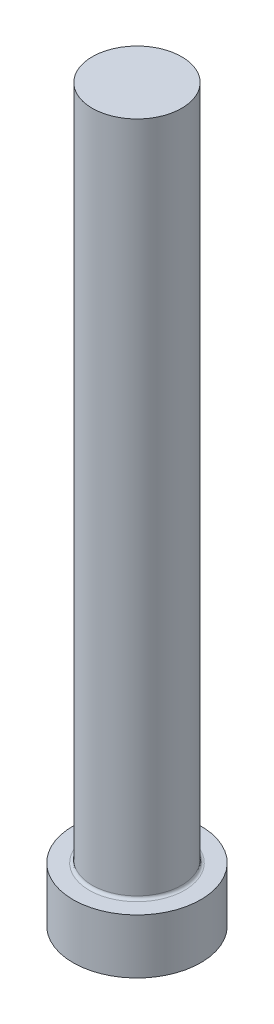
from build123d import *


with BuildPart() as part:
    # Sketch1 → Revolve3 (revolve)
    with BuildSketch(Plane.XY, mode=Mode.PRIVATE) as revolve3_sk:
        with BuildLine():
            Line((0, 0), (5.5499, 0))
            Line((5.5499, 0), (5.5499, 4.7498))
            Line((5.5499, 4.7498), (4.1402, 4.7498))
            ThreePointArc((4.1402, 4.7498), (3.960594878, 4.824194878), (3.8862, 5.0038))
            Line((3.8862, 5.0038), (3.8862, 63.5))
            Line((3.8862, 63.5), (0, 63.5))
            Line((0, 63.5), (0, 0))
        make_face()
    revolve(revolve3_sk.sketch.rotate(Axis((0, 0, 0), (0, -1, 0)), 90), axis=Axis((0, 0, 0), (0, -1, 0)))


solid = part.part
